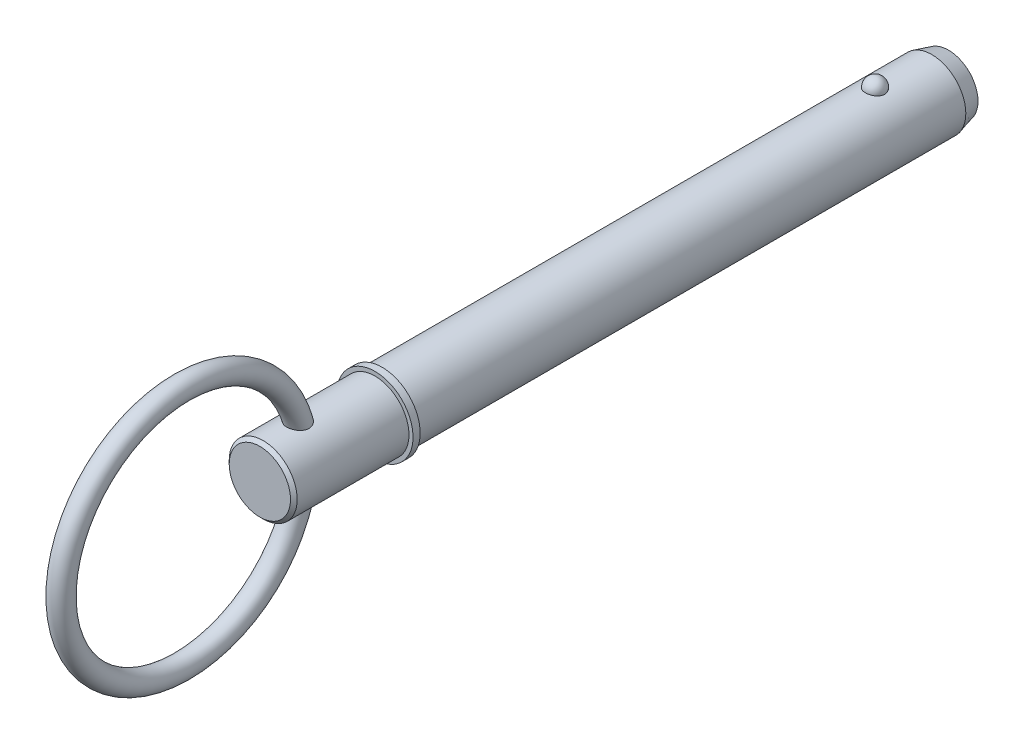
from build123d import *

# Parameters (mm, degrees)
SKETCH2_R           = 7.145
BOSS_EXTRUDE1_DEPTH = 101.6
BOSS_EXTRUDE2_START = 17.45
SKETCH3_R           = 7.145
BOSS_EXTRUDE2_DEPTH = 17.45
CHAMFER1_SIZE       = 3.5
CHAMFER1_SIZE2      = 0.937822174
SKETCH20_W          = 1.5
SKETCH20_H          = 8
SKETCH21_R          = 7.145
BOSS_EXTRUDE3_DEPTH = 25.7
CHAMFER2_SIZE       = 0.7
SKETCH24_R          = 2.25


with BuildPart() as part:
    # Sketch2 → Boss-Extrude1 (new body)
    with BuildSketch(Plane.XY):
        Circle(SKETCH2_R)
    extrude(amount=BOSS_EXTRUDE1_DEPTH)

    # Sketch3 → Boss-Extrude2 (add)
    with BuildSketch(Plane(origin=(0, 0, 0), x_dir=(-1, 0, 0), z_dir=(0, 0, -1)).offset(BOSS_EXTRUDE2_START)):
        Circle(SKETCH3_R)
    extrude(amount=-BOSS_EXTRUDE2_DEPTH)

    # Chamfer1
    chamfer1_edges = [part.edges().sort_by_distance(p)[0] for p in [
        (7.145, 0, -17.45),
    ]]
    chamfer1_side = [part.faces().sort_by_distance(p)[0] for p in [
        (7.145, 0, -8.725),
    ]]
    chamfer(chamfer1_edges, length=CHAMFER1_SIZE, length2=CHAMFER1_SIZE2, reference=chamfer1_side[0])

    # Sketch18 → Revolve1 (revolve)
    with BuildSketch(Plane(origin=(0, 0, 0), x_dir=(0, 0, -1), z_dir=(1, 0, 0))):
        with BuildLine():
            Line((2.02, 9.165), (2.02, 5.125))
            ThreePointArc((2.02, 5.125), (0, 7.145), (2.02, 9.165))
        make_face()
    revolve(axis=Axis((0, 9.165, -2.02), (0, -1, 0)))

    # Sketch20 → Revolve2 (revolve)
    with BuildSketch(Plane(origin=(0, 0, 0), x_dir=(0, 0, -1), z_dir=(1, 0, 0)), mode=Mode.PRIVATE) as revolve2_sk:
        with Locations((-102.35, 4)):
            Rectangle(SKETCH20_W, SKETCH20_H)
    revolve(revolve2_sk.sketch.rotate(Axis((0, 0, 33.728787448), (0, 0, 1)), 270), axis=Axis((0, 0, 33.728787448), (0, 0, 1)))

    # Sketch21 → Boss-Extrude3 (add)
    with BuildSketch(Plane(origin=(0, 0, 101.6), x_dir=(-1, 0, 0), z_dir=(0, 0, -1))):
        with Locations(Location((0, 0, 0), (0, 0, 180))):
            Circle(SKETCH21_R)
    extrude(amount=-BOSS_EXTRUDE3_DEPTH)

    # Chamfer2
    chamfer2_edges = [part.edges().sort_by_distance(p)[0] for p in [
        (-7.145, 0, 127.3),
    ]]
    chamfer(chamfer2_edges, length=CHAMFER2_SIZE)

    # Sweep1: sweep along a path in Sketch23
    with BuildLine(Plane(origin=(0, 0, 0), x_dir=(0, 0, -1), z_dir=(1, 0, 0))) as sweep1_path:
        CenterArc((-143.7, 0), 25.4, 0, 360)
    # Sketch24 → Sweep1 (sweep)
    with BuildSketch(Plane(origin=(0, 0, 0), x_dir=(1, 0, 0), z_dir=(0, 1, 0))):
        with Locations((0, -118.3)):
            Circle(SKETCH24_R)
    sweep(path=sweep1_path.line)


solid = part.part
